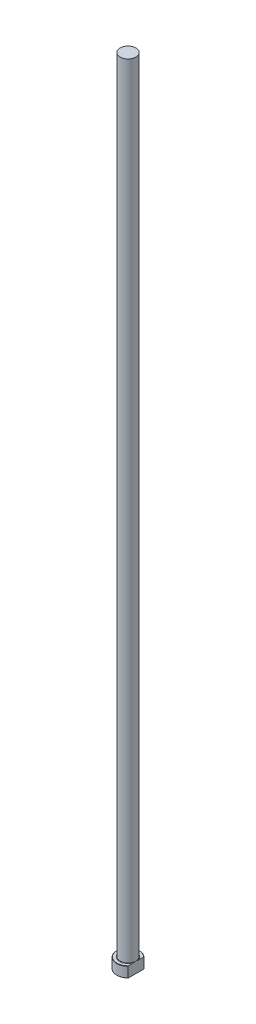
ISO-10303-21;
HEADER;
FILE_DESCRIPTION(('STEP AP214'),'2;1');
FILE_NAME('part.step','',(''),(''),'','','');
FILE_SCHEMA(('AUTOMOTIVE_DESIGN { 1 0 10303 214 1 1 1 1 }'));
ENDSEC;
DATA;
#1=APPLICATION_CONTEXT('core data for automotive mechanical design processes');
#2=APPLICATION_PROTOCOL_DEFINITION('international standard','automotive_design',2000,#1);
#3=PRODUCT_CONTEXT('',#1,'mechanical');
#4=PRODUCT('Part','Part','',(#3));
#5=PRODUCT_RELATED_PRODUCT_CATEGORY('part','',(#4));
#6=PRODUCT_DEFINITION_FORMATION('','',#4);
#7=PRODUCT_DEFINITION_CONTEXT('part definition',#1,'design');
#8=PRODUCT_DEFINITION('design','',#6,#7);
#9=PRODUCT_DEFINITION_SHAPE('','',#8);
#10=(LENGTH_UNIT() NAMED_UNIT(*) SI_UNIT(.MILLI.,.METRE.));
#11=(NAMED_UNIT(*) PLANE_ANGLE_UNIT() SI_UNIT($,.RADIAN.));
#12=(NAMED_UNIT(*) SI_UNIT($,.STERADIAN.) SOLID_ANGLE_UNIT());
#13=UNCERTAINTY_MEASURE_WITH_UNIT(LENGTH_MEASURE(1.E-05),#10,'distance_accuracy_value','');
#14=(GEOMETRIC_REPRESENTATION_CONTEXT(3) GLOBAL_UNCERTAINTY_ASSIGNED_CONTEXT((#13)) GLOBAL_UNIT_ASSIGNED_CONTEXT((#10,
#11,#12)) REPRESENTATION_CONTEXT('',''));
#15=CARTESIAN_POINT('',(0.,0.,0.));
#16=DIRECTION('',(0.,0.,1.));
#17=DIRECTION('',(1.,0.,0.));
#18=AXIS2_PLACEMENT_3D('',#15,#16,#17);
#19=CARTESIAN_POINT('',(0.,0.,0.));
#20=DIRECTION('',(0.,-1.,0.));
#21=DIRECTION('',(0.,0.,-1.));
#22=AXIS2_PLACEMENT_3D('',#19,#20,#21);
#23=PLANE('',#22);
#24=CARTESIAN_POINT('',(0.,0.,0.));
#25=DIRECTION('',(0.,-1.,0.));
#26=DIRECTION('',(0.,0.,-1.));
#27=AXIS2_PLACEMENT_3D('',#24,#25,#26);
#28=CIRCLE('',#27,8.29999999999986);
#29=CARTESIAN_POINT('',(5.99999999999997,0.,5.7349803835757));
#30=VERTEX_POINT('',#29);
#31=CARTESIAN_POINT('',(5.99999999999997,0.,-5.7349803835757));
#32=VERTEX_POINT('',#31);
#33=EDGE_CURVE('E98',#30,#32,#28,.T.);
#34=ORIENTED_EDGE('',*,*,#33,.T.);
#35=DIRECTION('',(0.,0.,1.));
#36=VECTOR('',#35,1.);
#37=CARTESIAN_POINT('',(5.99999999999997,0.,6.02079728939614));
#38=LINE('',#37,#36);
#39=EDGE_CURVE('E83',#32,#30,#38,.T.);
#40=ORIENTED_EDGE('',*,*,#39,.T.);
#41=EDGE_LOOP('',(#34,#40));
#42=FACE_BOUND('',#41,.T.);
#43=ADVANCED_FACE('F32',(#42),#23,.T.);
#44=CARTESIAN_POINT('',(0.,259.958771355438,0.));
#45=DIRECTION('',(0.,1.,0.));
#46=DIRECTION('',(0.,0.,1.));
#47=AXIS2_PLACEMENT_3D('',#44,#45,#46);
#48=CYLINDRICAL_SURFACE('',#47,8.49999999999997);
#49=CARTESIAN_POINT('',(0.,7.79999999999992,0.));
#50=DIRECTION('',(0.,1.,0.));
#51=DIRECTION('',(0.,0.,1.));
#52=AXIS2_PLACEMENT_3D('',#49,#50,#51);
#53=CIRCLE('',#52,8.49999999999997);
#54=CARTESIAN_POINT('',(5.99999999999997,7.79999999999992,6.02079728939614));
#55=VERTEX_POINT('',#54);
#56=CARTESIAN_POINT('',(5.99999999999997,7.79999999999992,-6.02079728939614));
#57=VERTEX_POINT('',#56);
#58=EDGE_CURVE('E104',#55,#57,#53,.F.);
#59=ORIENTED_EDGE('',*,*,#58,.T.);
#60=DIRECTION('',(0.,-1.,0.));
#61=VECTOR('',#60,1.);
#62=CARTESIAN_POINT('',(5.99999999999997,600.,-6.02079728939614));
#63=LINE('',#62,#61);
#64=CARTESIAN_POINT('',(5.99999999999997,0.200000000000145,-6.02079728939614));
#65=VERTEX_POINT('',#64);
#66=EDGE_CURVE('E183',#57,#65,#63,.T.);
#67=ORIENTED_EDGE('',*,*,#66,.T.);
#68=CARTESIAN_POINT('',(0.,0.200000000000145,0.));
#69=DIRECTION('',(0.,-1.,0.));
#70=DIRECTION('',(0.,0.,-1.));
#71=AXIS2_PLACEMENT_3D('',#68,#69,#70);
#72=CIRCLE('',#71,8.49999999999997);
#73=CARTESIAN_POINT('',(5.99999999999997,0.200000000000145,6.02079728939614));
#74=VERTEX_POINT('',#73);
#75=EDGE_CURVE('E100',#65,#74,#72,.F.);
#76=ORIENTED_EDGE('',*,*,#75,.T.);
#77=DIRECTION('',(0.,-1.,0.));
#78=VECTOR('',#77,1.);
#79=CARTESIAN_POINT('',(5.99999999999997,600.,6.02079728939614));
#80=LINE('',#79,#78);
#81=EDGE_CURVE('E93',#55,#74,#80,.T.);
#82=ORIENTED_EDGE('',*,*,#81,.F.);
#83=EDGE_LOOP('',(#59,#67,#76,#82));
#84=FACE_BOUND('',#83,.T.);
#85=ADVANCED_FACE('F158',(#84),#48,.T.);
#86=CARTESIAN_POINT('',(-8.49999999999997,8.,0.));
#87=DIRECTION('',(0.,1.,0.));
#88=DIRECTION('',(0.,0.,1.));
#89=AXIS2_PLACEMENT_3D('',#86,#87,#88);
#90=PLANE('',#89);
#91=CARTESIAN_POINT('',(0.,8.,0.));
#92=DIRECTION('',(0.,1.,0.));
#93=DIRECTION('',(0.,0.,1.));
#94=AXIS2_PLACEMENT_3D('',#91,#92,#93);
#95=CIRCLE('',#94,8.29999999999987);
#96=CARTESIAN_POINT('',(5.99999999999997,8.,-5.73498038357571));
#97=VERTEX_POINT('',#96);
#98=CARTESIAN_POINT('',(5.99999999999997,8.,5.73498038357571));
#99=VERTEX_POINT('',#98);
#100=EDGE_CURVE('E178',#97,#99,#95,.T.);
#101=ORIENTED_EDGE('',*,*,#100,.T.);
#102=DIRECTION('',(0.,0.,-1.));
#103=VECTOR('',#102,1.);
#104=CARTESIAN_POINT('',(5.99999999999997,8.,0.));
#105=LINE('',#104,#103);
#106=CARTESIAN_POINT('',(5.99999999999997,7.99999999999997,1.92093727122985));
#107=VERTEX_POINT('',#106);
#108=EDGE_CURVE('E57',#99,#107,#105,.T.);
#109=ORIENTED_EDGE('',*,*,#108,.T.);
#110=CARTESIAN_POINT('',(0.,8.,0.));
#111=DIRECTION('',(0.,1.,0.));
#112=DIRECTION('',(0.,0.,1.));
#113=AXIS2_PLACEMENT_3D('',#110,#111,#112);
#114=CIRCLE('',#113,6.29999999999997);
#115=CARTESIAN_POINT('',(5.99999999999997,7.99999999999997,-1.92093727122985));
#116=VERTEX_POINT('',#115);
#117=EDGE_CURVE('E107',#107,#116,#114,.F.);
#118=ORIENTED_EDGE('',*,*,#117,.T.);
#119=EDGE_CURVE('E136',#116,#97,#105,.T.);
#120=ORIENTED_EDGE('',*,*,#119,.T.);
#121=EDGE_LOOP('',(#101,#109,#118,#120));
#122=FACE_BOUND('',#121,.T.);
#123=ADVANCED_FACE('F147',(#122),#90,.T.);
#124=CARTESIAN_POINT('',(0.,8.00000000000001,0.));
#125=DIRECTION('',(0.,-1.,0.));
#126=DIRECTION('',(0.,0.,-1.));
#127=AXIS2_PLACEMENT_3D('',#124,#125,#126);
#128=CONICAL_SURFACE('',#127,8.29999999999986,0.785398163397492);
#129=ORIENTED_EDGE('',*,*,#58,.F.);
#130=CARTESIAN_POINT('',(5.99999999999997,1.75758968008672,13.2469505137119));
#131=CARTESIAN_POINT('',(5.99999999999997,1.93438223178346,13.0528651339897));
#132=CARTESIAN_POINT('',(5.99999999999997,2.11081737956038,12.8584542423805));
#133=CARTESIAN_POINT('',(5.99999999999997,2.46286810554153,12.4688887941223));
#134=CARTESIAN_POINT('',(5.99999999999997,2.63848367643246,12.2737342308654));
#135=CARTESIAN_POINT('',(5.99999999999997,3.16402789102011,11.6869221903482));
#136=CARTESIAN_POINT('',(5.99999999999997,3.51256436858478,11.2940145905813));
#137=CARTESIAN_POINT('',(5.99999999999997,4.20737297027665,10.5008820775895));
#138=CARTESIAN_POINT('',(5.99999999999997,4.55360756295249,10.1006242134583));
#139=CARTESIAN_POINT('',(5.99999999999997,5.23924501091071,9.29437446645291));
#140=CARTESIAN_POINT('',(5.99999999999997,5.57864880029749,8.88838338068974));
#141=CARTESIAN_POINT('',(5.99999999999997,6.20014365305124,8.12701556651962));
#142=CARTESIAN_POINT('',(5.99999999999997,6.48350363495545,7.77268056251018));
#143=CARTESIAN_POINT('',(5.99999999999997,6.90118479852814,7.23535305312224));
#144=CARTESIAN_POINT('',(5.99999999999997,7.03920968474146,7.05523994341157));
#145=CARTESIAN_POINT('',(5.99999999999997,7.31228512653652,6.69277597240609));
#146=CARTESIAN_POINT('',(5.99999999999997,7.4473357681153,6.51042517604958));
#147=CARTESIAN_POINT('',(5.99999999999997,7.71365491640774,6.14339029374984));
#148=CARTESIAN_POINT('',(5.99999999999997,7.84492875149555,5.95871008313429));
#149=CARTESIAN_POINT('',(5.99999999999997,8.10310710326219,5.58632824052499));
#150=CARTESIAN_POINT('',(5.99999999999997,8.23001189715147,5.3986268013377));
#151=CARTESIAN_POINT('',(5.99999999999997,8.47838103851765,5.01977879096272));
#152=CARTESIAN_POINT('',(5.99999999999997,8.59984807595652,4.828633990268));
#153=CARTESIAN_POINT('',(5.99999999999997,8.8360687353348,4.44225695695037));
#154=CARTESIAN_POINT('',(5.99999999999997,8.95082335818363,4.24702533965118));
#155=CARTESIAN_POINT('',(5.99999999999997,9.16834438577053,3.85819092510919));
#156=CARTESIAN_POINT('',(5.99999999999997,9.27137801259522,3.66473854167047));
#157=CARTESIAN_POINT('',(5.99999999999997,9.46754050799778,3.27281000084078));
#158=CARTESIAN_POINT('',(5.99999999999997,9.56066848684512,3.07433339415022));
#159=CARTESIAN_POINT('',(5.99999999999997,9.73431152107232,2.67227927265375));
#160=CARTESIAN_POINT('',(5.99999999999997,9.81484758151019,2.46871092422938));
#161=CARTESIAN_POINT('',(5.99999999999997,9.96042306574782,2.05607448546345));
#162=CARTESIAN_POINT('',(5.99999999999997,10.0254667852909,1.84700793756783));
#163=CARTESIAN_POINT('',(5.99999999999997,10.1264114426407,1.46315432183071));
#164=CARTESIAN_POINT('',(5.99999999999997,10.165480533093,1.28920535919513));
#165=CARTESIAN_POINT('',(5.99999999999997,10.2294553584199,0.938706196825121));
#166=CARTESIAN_POINT('',(5.99999999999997,10.2543631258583,0.762156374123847));
#167=CARTESIAN_POINT('',(5.99999999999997,10.2887297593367,0.407890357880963));
#168=CARTESIAN_POINT('',(5.99999999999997,10.2982190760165,0.230177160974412));
#169=CARTESIAN_POINT('',(5.99999999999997,10.3013234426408,-0.125392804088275));
#170=CARTESIAN_POINT('',(5.99999999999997,10.2949382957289,-0.30324957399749));
#171=CARTESIAN_POINT('',(5.99999999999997,10.2666831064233,-0.65724997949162));
#172=CARTESIAN_POINT('',(5.99999999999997,10.2448527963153,-0.833396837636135));
#173=CARTESIAN_POINT('',(5.99999999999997,10.1868620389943,-1.18332422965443));
#174=CARTESIAN_POINT('',(5.99999999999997,10.1506981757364,-1.35710418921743));
#175=CARTESIAN_POINT('',(5.99999999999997,10.0655340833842,-1.70193222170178));
#176=CARTESIAN_POINT('',(5.99999999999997,10.0165006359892,-1.87297199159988));
#177=CARTESIAN_POINT('',(5.99999999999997,9.90743707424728,-2.21145638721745));
#178=CARTESIAN_POINT('',(5.99999999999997,9.8474075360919,-2.37890120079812));
#179=CARTESIAN_POINT('',(5.99999999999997,9.69449933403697,-2.77055604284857));
#180=CARTESIAN_POINT('',(5.99999999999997,9.59762441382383,-2.99320000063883));
#181=CARTESIAN_POINT('',(5.99999999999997,9.39041412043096,-3.43217897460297));
#182=CARTESIAN_POINT('',(5.99999999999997,9.28007160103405,-3.64851056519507));
#183=CARTESIAN_POINT('',(5.99999999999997,9.04872697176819,-4.07594347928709));
#184=CARTESIAN_POINT('',(5.99999999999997,8.92770286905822,-4.28703280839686));
#185=CARTESIAN_POINT('',(5.99999999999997,8.67752421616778,-4.70425268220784));
#186=CARTESIAN_POINT('',(5.99999999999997,8.54837109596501,-4.91038409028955));
#187=CARTESIAN_POINT('',(5.99999999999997,8.28223284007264,-5.3206400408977));
#188=CARTESIAN_POINT('',(5.99999999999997,8.14517883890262,-5.52471970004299));
#189=CARTESIAN_POINT('',(5.99999999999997,7.86585169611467,-5.9292712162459));
#190=CARTESIAN_POINT('',(5.99999999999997,7.7235783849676,-6.12974295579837));
#191=CARTESIAN_POINT('',(5.99999999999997,7.43500571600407,-6.52738897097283));
#192=CARTESIAN_POINT('',(5.99999999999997,7.28871143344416,-6.72456694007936));
#193=CARTESIAN_POINT('',(5.99999999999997,6.99270011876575,-7.11633919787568));
#194=CARTESIAN_POINT('',(5.99999999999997,6.84298299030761,-7.3109334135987));
#195=CARTESIAN_POINT('',(5.99999999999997,6.49456418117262,-7.75702816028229));
#196=CARTESIAN_POINT('',(5.99999999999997,6.29487025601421,-8.0077529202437));
#197=CARTESIAN_POINT('',(5.99999999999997,5.89169138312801,-8.50613413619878));
#198=CARTESIAN_POINT('',(5.99999999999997,5.68820636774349,-8.7537905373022));
#199=CARTESIAN_POINT('',(5.99999999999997,5.27809760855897,-9.24667622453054));
#200=CARTESIAN_POINT('',(5.99999999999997,5.07147248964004,-9.4919043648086));
#201=CARTESIAN_POINT('',(5.99999999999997,4.65573644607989,-9.98024423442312));
#202=CARTESIAN_POINT('',(5.99999999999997,4.44662550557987,-10.2233559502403));
#203=CARTESIAN_POINT('',(5.99999999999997,4.03294810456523,-10.7001949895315));
#204=CARTESIAN_POINT('',(5.99999999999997,3.82844502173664,-10.9339773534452));
#205=CARTESIAN_POINT('',(5.99999999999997,3.41782118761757,-11.4001180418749));
#206=CARTESIAN_POINT('',(5.99999999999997,3.21170042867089,-11.6324763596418));
#207=CARTESIAN_POINT('',(5.99999999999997,2.79824862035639,-12.0957939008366));
#208=CARTESIAN_POINT('',(5.99999999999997,2.59091861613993,-12.3267540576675));
#209=CARTESIAN_POINT('',(5.99999999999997,2.17508648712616,-12.7876097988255));
#210=CARTESIAN_POINT('',(5.99999999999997,1.96658438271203,-13.0175054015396));
#211=CARTESIAN_POINT('',(5.99999999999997,1.75758968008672,-13.2469505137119));
#212=B_SPLINE_CURVE_WITH_KNOTS('',3,(#130,#131,#132,#133,#134,#135,#136,#137,#138,#139,#140,
#141,#142,#143,#144,#145,#146,#147,#148,#149,#150,#151,#152,#153,#154,#155,#156,#157,#158,#159,
#160,#161,#162,#163,#164,#165,#166,#167,#168,#169,#170,#171,#172,#173,#174,#175,#176,#177,#178,
#179,#180,#181,#182,#183,#184,#185,#186,#187,#188,#189,#190,#191,#192,#193,#194,#195,#196,#197,
#198,#199,#200,#201,#202,#203,#204,#205,#206,#207,#208,#209,#210,#211),.UNSPECIFIED.,.F.,.F.,(4,
2,2,2,2,2,2,2,2,2,2,2,2,2,2,2,2,2,2,2,2,2,2,2,2,2,2,2,2,2,2,2,2,2,2,2,2,2,2,2,4),(0.,
0.78760481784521,1.57521665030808,3.15083930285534,4.73847641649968,6.32589492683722,
7.68685989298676,8.36758868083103,9.04829776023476,9.72799402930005,10.407647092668,
11.0869601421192,11.7661716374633,12.4234853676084,13.0808580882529,13.7371222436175,
14.3932042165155,14.9275387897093,15.4617966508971,15.9949980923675,16.5282061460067,
17.0600474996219,17.5920156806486,18.1253706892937,18.6586977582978,19.3865060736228,
20.1147022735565,20.8444344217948,21.5740385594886,22.3114278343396,23.0488410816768,
23.7853628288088,24.5219053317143,25.4834511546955,26.4450141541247,27.4070111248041,
28.3690142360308,29.3008217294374,30.2326336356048,31.1637335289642,32.094817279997),.UNSPECIFIED.);
#213=EDGE_CURVE('E135',#55,#99,#212,.T.);
#214=ORIENTED_EDGE('',*,*,#213,.T.);
#215=ORIENTED_EDGE('',*,*,#100,.F.);
#216=EDGE_CURVE('E127',#97,#57,#212,.T.);
#217=ORIENTED_EDGE('',*,*,#216,.T.);
#218=EDGE_LOOP('',(#129,#214,#215,#217));
#219=FACE_BOUND('',#218,.T.);
#220=ADVANCED_FACE('F143',(#219),#128,.T.);
#221=CARTESIAN_POINT('',(0.,0.200000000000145,0.));
#222=DIRECTION('',(0.,1.,0.));
#223=DIRECTION('',(0.,0.,1.));
#224=AXIS2_PLACEMENT_3D('',#221,#222,#223);
#225=CONICAL_SURFACE('',#224,8.49999999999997,0.785398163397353);
#226=ORIENTED_EDGE('',*,*,#75,.F.);
#227=CARTESIAN_POINT('',(5.99999999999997,6.24241031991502,-13.2469505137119));
#228=CARTESIAN_POINT('',(5.99999999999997,6.06561776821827,-13.0528651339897));
#229=CARTESIAN_POINT('',(5.99999999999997,5.88918262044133,-12.8584542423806));
#230=CARTESIAN_POINT('',(5.99999999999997,5.53713189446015,-12.4688887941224));
#231=CARTESIAN_POINT('',(5.99999999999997,5.3615163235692,-12.2737342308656));
#232=CARTESIAN_POINT('',(5.99999999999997,4.8359721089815,-11.6869221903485));
#233=CARTESIAN_POINT('',(5.99999999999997,4.48743563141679,-11.2940145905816));
#234=CARTESIAN_POINT('',(5.99999999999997,3.79262702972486,-10.50088207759));
#235=CARTESIAN_POINT('',(5.99999999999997,3.44639243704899,-10.1006242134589));
#236=CARTESIAN_POINT('',(5.99999999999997,2.76075498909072,-9.29437446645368));
#237=CARTESIAN_POINT('',(5.99999999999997,2.42135119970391,-8.8883833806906));
#238=CARTESIAN_POINT('',(5.99999999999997,1.7998563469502,-8.12701556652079));
#239=CARTESIAN_POINT('',(5.99999999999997,1.51649636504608,-7.77268056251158));
#240=CARTESIAN_POINT('',(5.99999999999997,1.09881520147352,-7.23535305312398));
#241=CARTESIAN_POINT('',(5.99999999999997,0.960790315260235,-7.05523994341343));
#242=CARTESIAN_POINT('',(5.99999999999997,0.687714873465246,-6.69277597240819));
#243=CARTESIAN_POINT('',(5.99999999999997,0.552664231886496,-6.5104251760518));
#244=CARTESIAN_POINT('',(5.99999999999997,0.286345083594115,-6.14339029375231));
#245=CARTESIAN_POINT('',(5.99999999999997,0.155071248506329,-5.95871008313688));
#246=CARTESIAN_POINT('',(5.99999999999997,-0.103107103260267,-5.58632824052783));
#247=CARTESIAN_POINT('',(5.99999999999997,-0.230011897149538,-5.39862680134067));
#248=CARTESIAN_POINT('',(5.99999999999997,-0.478381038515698,-5.01977879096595));
#249=CARTESIAN_POINT('',(5.99999999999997,-0.599848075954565,-4.82863399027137));
#250=CARTESIAN_POINT('',(5.99999999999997,-0.836068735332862,-4.44225695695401));
#251=CARTESIAN_POINT('',(5.99999999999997,-0.950823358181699,-4.24702533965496));
#252=CARTESIAN_POINT('',(5.99999999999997,-1.16834438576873,-3.8581909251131));
#253=CARTESIAN_POINT('',(5.99999999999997,-1.27137801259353,-3.66473854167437));
#254=CARTESIAN_POINT('',(5.99999999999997,-1.46754050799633,-3.27281000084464));
#255=CARTESIAN_POINT('',(5.99999999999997,-1.56066848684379,-3.07433339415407));
#256=CARTESIAN_POINT('',(5.99999999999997,-1.73431152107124,-2.67227927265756));
#257=CARTESIAN_POINT('',(5.99999999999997,-1.81484758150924,-2.46871092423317));
#258=CARTESIAN_POINT('',(5.99999999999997,-1.96042306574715,-2.05607448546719));
#259=CARTESIAN_POINT('',(5.99999999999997,-2.02546678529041,-1.84700793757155));
#260=CARTESIAN_POINT('',(5.99999999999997,-2.12641144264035,-1.46315432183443));
#261=CARTESIAN_POINT('',(5.99999999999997,-2.16548053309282,-1.28920535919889));
#262=CARTESIAN_POINT('',(5.99999999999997,-2.22945535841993,-0.938706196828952));
#263=CARTESIAN_POINT('',(5.99999999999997,-2.25436312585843,-0.76215637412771));
#264=CARTESIAN_POINT('',(5.99999999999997,-2.28872975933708,-0.407890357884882));
#265=CARTESIAN_POINT('',(5.99999999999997,-2.298219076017,-0.230177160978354));
#266=CARTESIAN_POINT('',(5.99999999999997,-2.30132344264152,0.125392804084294));
#267=CARTESIAN_POINT('',(5.99999999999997,-2.29493829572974,0.303249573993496));
#268=CARTESIAN_POINT('',(5.99999999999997,-2.2666831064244,0.657249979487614));
#269=CARTESIAN_POINT('',(5.99999999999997,-2.24485279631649,0.833396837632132));
#270=CARTESIAN_POINT('',(5.99999999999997,-2.18686203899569,1.18332422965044));
#271=CARTESIAN_POINT('',(5.99999999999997,-2.15069817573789,1.35710418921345));
#272=CARTESIAN_POINT('',(5.99999999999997,-2.06553408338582,1.70193222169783));
#273=CARTESIAN_POINT('',(5.99999999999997,-2.01650063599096,1.87297199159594));
#274=CARTESIAN_POINT('',(5.99999999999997,-1.90743707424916,2.21145638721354));
#275=CARTESIAN_POINT('',(5.99999999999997,-1.84740753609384,2.37890120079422));
#276=CARTESIAN_POINT('',(5.99999999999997,-1.69449933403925,2.77055604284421));
#277=CARTESIAN_POINT('',(5.99999999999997,-1.59762441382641,2.99320000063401));
#278=CARTESIAN_POINT('',(5.99999999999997,-1.39041412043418,3.43217897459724));
#279=CARTESIAN_POINT('',(5.99999999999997,-1.2800716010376,3.6485105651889));
#280=CARTESIAN_POINT('',(5.99999999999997,-1.04872697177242,4.07594347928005));
#281=CARTESIAN_POINT('',(5.99999999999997,-0.927702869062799,4.2870328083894));
#282=CARTESIAN_POINT('',(5.99999999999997,-0.677524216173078,4.70425268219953));
#283=CARTESIAN_POINT('',(5.99999999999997,-0.548371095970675,4.91038409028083));
#284=CARTESIAN_POINT('',(5.99999999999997,-0.282232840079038,5.32064004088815));
#285=CARTESIAN_POINT('',(5.99999999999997,-0.1451788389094,5.52471970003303));
#286=CARTESIAN_POINT('',(5.99999999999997,0.134148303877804,5.92927121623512));
#287=CARTESIAN_POINT('',(5.99999999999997,0.276421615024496,6.12974295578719));
#288=CARTESIAN_POINT('',(5.99999999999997,0.564994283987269,6.52738897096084));
#289=CARTESIAN_POINT('',(5.99999999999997,0.711288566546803,6.72456694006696));
#290=CARTESIAN_POINT('',(5.99999999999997,1.00729988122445,7.11633919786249));
#291=CARTESIAN_POINT('',(5.99999999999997,1.15701700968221,7.31093341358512));
#292=CARTESIAN_POINT('',(5.99999999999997,1.50543581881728,7.757028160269));
#293=CARTESIAN_POINT('',(5.99999999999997,1.70512974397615,8.00775292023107));
#294=CARTESIAN_POINT('',(5.99999999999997,2.10830861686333,8.50613413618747));
#295=CARTESIAN_POINT('',(5.99999999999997,2.31179363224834,8.75379053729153));
#296=CARTESIAN_POINT('',(5.99999999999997,2.7219023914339,9.24667622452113));
#297=CARTESIAN_POINT('',(5.99999999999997,2.92852751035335,9.49190436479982));
#298=CARTESIAN_POINT('',(5.99999999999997,3.34426355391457,9.98024423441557));
#299=CARTESIAN_POINT('',(5.99999999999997,3.55337449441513,10.2233559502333));
#300=CARTESIAN_POINT('',(5.99999999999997,3.96705189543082,10.7001949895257));
#301=CARTESIAN_POINT('',(5.99999999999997,4.17155497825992,10.9339773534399));
#302=CARTESIAN_POINT('',(5.99999999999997,4.58217881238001,11.4001180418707));
#303=CARTESIAN_POINT('',(5.99999999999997,4.7882995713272,11.6324763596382));
#304=CARTESIAN_POINT('',(5.99999999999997,5.20175137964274,12.095793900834));
#305=CARTESIAN_POINT('',(5.99999999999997,5.40908138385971,12.3267540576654));
#306=CARTESIAN_POINT('',(5.99999999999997,5.82491351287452,12.7876097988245));
#307=CARTESIAN_POINT('',(5.99999999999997,6.03341561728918,13.0175054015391));
#308=CARTESIAN_POINT('',(5.99999999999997,6.24241031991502,13.2469505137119));
#309=B_SPLINE_CURVE_WITH_KNOTS('',3,(#227,#228,#229,#230,#231,#232,#233,#234,#235,#236,#237,
#238,#239,#240,#241,#242,#243,#244,#245,#246,#247,#248,#249,#250,#251,#252,#253,#254,#255,#256,
#257,#258,#259,#260,#261,#262,#263,#264,#265,#266,#267,#268,#269,#270,#271,#272,#273,#274,#275,
#276,#277,#278,#279,#280,#281,#282,#283,#284,#285,#286,#287,#288,#289,#290,#291,#292,#293,#294,
#295,#296,#297,#298,#299,#300,#301,#302,#303,#304,#305,#306,#307,#308),.UNSPECIFIED.,.F.,.F.,(4,
2,2,2,2,2,2,2,2,2,2,2,2,2,2,2,2,2,2,2,2,2,2,2,2,2,2,2,2,2,2,2,2,2,2,2,2,2,2,2,4),(0.,
0.787604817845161,1.57521665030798,3.15083930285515,4.73847641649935,6.32589492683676,
7.68685989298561,8.36758868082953,9.0482977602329,9.72799402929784,10.4076470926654,
11.0869601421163,11.76617163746,12.4234853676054,13.08085808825,13.7371222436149,
14.3932042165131,14.9275387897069,15.4617966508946,15.9949980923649,16.5282061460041,
17.0600474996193,17.5920156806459,18.125370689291,18.658697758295,19.3865060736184,
20.1147022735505,20.8444344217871,21.5740385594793,22.3114278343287,23.0488410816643,
23.7853628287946,24.5219053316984,25.4834511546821,26.4450141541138,27.4070111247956,
28.3690142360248,29.3008217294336,30.2326336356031,31.1637335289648,32.0948172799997),.UNSPECIFIED.);
#310=EDGE_CURVE('E86',#65,#32,#309,.T.);
#311=ORIENTED_EDGE('',*,*,#310,.T.);
#312=ORIENTED_EDGE('',*,*,#33,.F.);
#313=EDGE_CURVE('E89',#30,#74,#309,.T.);
#314=ORIENTED_EDGE('',*,*,#313,.T.);
#315=EDGE_LOOP('',(#226,#311,#312,#314));
#316=FACE_BOUND('',#315,.T.);
#317=ADVANCED_FACE('F97',(#316),#225,.T.);
#318=CARTESIAN_POINT('',(0.,8.29999999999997,0.));
#319=DIRECTION('',(0.,1.,0.));
#320=DIRECTION('',(0.,0.,1.));
#321=AXIS2_PLACEMENT_3D('',#318,#319,#320);
#322=TOROIDAL_SURFACE('',#321,6.29999999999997,0.3);
#323=CARTESIAN_POINT('',(5.99999999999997,8.29999999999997,0.));
#324=CARTESIAN_POINT('',(5.99999999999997,8.30000062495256,1.34604190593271E-10));
#325=CARTESIAN_POINT('',(5.99999999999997,8.30000124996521,-2.85495124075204E-07));
#326=CARTESIAN_POINT('',(5.99999999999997,8.30000241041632,-1.04928093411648E-06));
#327=CARTESIAN_POINT('',(5.99999999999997,8.3000029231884,-1.54785174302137E-06));
#328=CARTESIAN_POINT('',(5.99999999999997,8.30000401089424,-2.74944388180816E-06));
#329=CARTESIAN_POINT('',(5.99999999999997,8.30000456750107,-3.47196545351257E-06));
#330=CARTESIAN_POINT('',(5.99999999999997,8.30000554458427,-4.95172589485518E-06));
#331=CARTESIAN_POINT('',(5.99999999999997,8.30000596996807,-5.70604371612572E-06));
#332=CARTESIAN_POINT('',(5.99999999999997,8.30000759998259,-8.69525120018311E-06));
#333=CARTESIAN_POINT('',(5.99999999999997,8.30000872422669,-1.09781829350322E-05));
#334=CARTESIAN_POINT('',(5.99999999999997,8.30001052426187,-1.54456348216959E-05));
#335=CARTESIAN_POINT('',(5.99999999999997,8.30001123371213,-1.7617076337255E-05));
#336=CARTESIAN_POINT('',(5.99999999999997,8.30001429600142,-2.6992812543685E-05));
#337=CARTESIAN_POINT('',(5.99999999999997,8.30001664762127,-3.4200026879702E-05));
#338=CARTESIAN_POINT('',(5.99999999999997,8.30002002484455,-4.76829004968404E-05));
#339=CARTESIAN_POINT('',(5.99999999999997,8.30002120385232,-5.39195612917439E-05));
#340=CARTESIAN_POINT('',(5.99999999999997,8.3000299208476,-0.000100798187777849));
#341=CARTESIAN_POINT('',(5.99999999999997,8.30003667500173,-0.00014152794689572));
#342=CARTESIAN_POINT('',(5.99999999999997,8.30006623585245,-0.000303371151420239));
#343=CARTESIAN_POINT('',(5.99999999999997,8.30009428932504,-0.000423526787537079));
#344=CARTESIAN_POINT('',(5.99999999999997,8.30020425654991,-0.000901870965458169));
#345=CARTESIAN_POINT('',(5.99999999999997,8.30028289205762,-0.00126055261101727));
#346=CARTESIAN_POINT('',(5.99999999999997,8.3005993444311,-0.00269405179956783));
#347=CARTESIAN_POINT('',(5.99999999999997,8.30084137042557,-0.00376821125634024));
#348=CARTESIAN_POINT('',(5.99999999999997,8.30185255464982,-0.0082672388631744));
#349=CARTESIAN_POINT('',(5.99999999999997,8.30261638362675,-0.0116929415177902));
#350=CARTESIAN_POINT('',(5.99999999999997,8.30945824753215,-0.0423635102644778));
#351=CARTESIAN_POINT('',(5.99999999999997,8.31555811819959,-0.0696050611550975));
#352=CARTESIAN_POINT('',(5.99999999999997,8.3274771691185,-0.122985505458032));
#353=CARTESIAN_POINT('',(5.99999999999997,8.33329766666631,-0.149124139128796));
#354=CARTESIAN_POINT('',(5.99999999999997,8.34565922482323,-0.204790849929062));
#355=CARTESIAN_POINT('',(5.99999999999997,8.35219607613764,-0.234319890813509));
#356=CARTESIAN_POINT('',(5.99999999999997,8.36527652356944,-0.293721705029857));
#357=CARTESIAN_POINT('',(5.99999999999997,8.37181938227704,-0.323594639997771));
#358=CARTESIAN_POINT('',(5.99999999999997,8.38741819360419,-0.395325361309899));
#359=CARTESIAN_POINT('',(5.99999999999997,8.39643140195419,-0.437192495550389));
#360=CARTESIAN_POINT('',(5.99999999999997,8.41397520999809,-0.519837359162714));
#361=CARTESIAN_POINT('',(5.99999999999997,8.42251226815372,-0.560613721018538));
#362=CARTESIAN_POINT('',(5.99999999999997,8.45005469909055,-0.694529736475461));
#363=CARTESIAN_POINT('',(5.99999999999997,8.4684527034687,-0.787796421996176));
#364=CARTESIAN_POINT('',(5.99999999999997,8.50309772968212,-0.975673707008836));
#365=CARTESIAN_POINT('',(5.99999999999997,8.51932210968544,-1.07028855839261));
#366=CARTESIAN_POINT('',(5.99999999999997,8.54979671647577,-1.26922112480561));
#367=CARTESIAN_POINT('',(5.99999999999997,8.56370439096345,-1.37359247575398));
#368=CARTESIAN_POINT('',(5.99999999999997,8.58567213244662,-1.58267692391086));
#369=CARTESIAN_POINT('',(5.99999999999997,8.59375049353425,-1.6873879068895));
#370=CARTESIAN_POINT('',(5.99999999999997,8.59943466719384,-1.84308999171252));
#371=CARTESIAN_POINT('',(5.99999999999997,8.60029184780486,-1.89396002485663));
#372=CARTESIAN_POINT('',(5.99999999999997,8.5995288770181,-1.99574511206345));
#373=CARTESIAN_POINT('',(5.99999999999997,8.59790613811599,-2.04666015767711));
#374=CARTESIAN_POINT('',(5.99999999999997,8.59158346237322,-2.14740525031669));
#375=CARTESIAN_POINT('',(5.99999999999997,8.58693864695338,-2.1972385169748));
#376=CARTESIAN_POINT('',(5.99999999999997,8.57369485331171,-2.29634018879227));
#377=CARTESIAN_POINT('',(5.99999999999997,8.56510170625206,-2.34560931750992));
#378=CARTESIAN_POINT('',(5.99999999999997,8.54513600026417,-2.43101613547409));
#379=CARTESIAN_POINT('',(5.99999999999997,8.53495732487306,-2.46741817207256));
#380=CARTESIAN_POINT('',(5.99999999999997,8.5163599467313,-2.52083307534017));
#381=CARTESIAN_POINT('',(5.99999999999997,8.50961541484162,-2.53842082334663));
#382=CARTESIAN_POINT('',(5.99999999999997,8.49476050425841,-2.57300282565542));
#383=CARTESIAN_POINT('',(5.99999999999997,8.48665036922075,-2.58999718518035));
#384=CARTESIAN_POINT('',(5.99999999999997,8.4656679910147,-2.62872971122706));
#385=CARTESIAN_POINT('',(5.99999999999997,8.45211281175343,-2.65012863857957));
#386=CARTESIAN_POINT('',(5.99999999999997,8.42848584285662,-2.67978235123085));
#387=CARTESIAN_POINT('',(5.99999999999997,8.42001211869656,-2.68929941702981));
#388=CARTESIAN_POINT('',(5.99999999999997,8.40175979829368,-2.70700164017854));
#389=CARTESIAN_POINT('',(5.99999999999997,8.3919842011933,-2.71518976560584));
#390=CARTESIAN_POINT('',(5.99999999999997,8.37475773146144,-2.72695700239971));
#391=CARTESIAN_POINT('',(5.99999999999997,8.36772137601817,-2.73113834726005));
#392=CARTESIAN_POINT('',(5.99999999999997,8.35309194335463,-2.73838811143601));
#393=CARTESIAN_POINT('',(5.99999999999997,8.34549938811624,-2.7414575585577));
#394=CARTESIAN_POINT('',(5.99999999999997,8.32979919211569,-2.74623687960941));
#395=CARTESIAN_POINT('',(5.99999999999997,8.32168697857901,-2.74793213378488));
#396=CARTESIAN_POINT('',(5.99999999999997,8.30528814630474,-2.74970225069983));
#397=CARTESIAN_POINT('',(5.99999999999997,8.29700168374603,-2.74977850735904));
#398=CARTESIAN_POINT('',(5.99999999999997,8.2816016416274,-2.74839814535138));
#399=CARTESIAN_POINT('',(5.99999999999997,8.27447007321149,-2.74713049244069));
#400=CARTESIAN_POINT('',(5.99999999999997,8.26050316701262,-2.74347158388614));
#401=CARTESIAN_POINT('',(5.99999999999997,8.25366802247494,-2.7410796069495));
#402=CARTESIAN_POINT('',(5.99999999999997,8.23783277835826,-2.73423902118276));
#403=CARTESIAN_POINT('',(5.99999999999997,8.22902314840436,-2.72935244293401));
#404=CARTESIAN_POINT('',(5.99999999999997,8.21228574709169,-2.7182516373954));
#405=CARTESIAN_POINT('',(5.99999999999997,8.20436026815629,-2.71203407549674));
#406=CARTESIAN_POINT('',(5.99999999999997,8.18433696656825,-2.69420240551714));
#407=CARTESIAN_POINT('',(5.99999999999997,8.17298706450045,-2.68175715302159));
#408=CARTESIAN_POINT('',(5.99999999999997,8.15219498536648,-2.65539556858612));
#409=CARTESIAN_POINT('',(5.99999999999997,8.14275658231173,-2.64147640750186));
#410=CARTESIAN_POINT('',(5.99999999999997,8.12508934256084,-2.61223187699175));
#411=CARTESIAN_POINT('',(5.99999999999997,8.11691464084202,-2.59687428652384));
#412=CARTESIAN_POINT('',(5.99999999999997,8.10186133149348,-2.56552911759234));
#413=CARTESIAN_POINT('',(5.99999999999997,8.09498416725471,-2.54954086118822));
#414=CARTESIAN_POINT('',(5.99999999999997,8.07586257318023,-2.50075322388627));
#415=CARTESIAN_POINT('',(5.99999999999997,8.06523495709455,-2.46732486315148));
#416=CARTESIAN_POINT('',(5.99999999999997,8.04175411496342,-2.38014114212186));
#417=CARTESIAN_POINT('',(5.99999999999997,8.0311656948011,-2.32580591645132));
#418=CARTESIAN_POINT('',(5.99999999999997,8.01502027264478,-2.21628778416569));
#419=CARTESIAN_POINT('',(5.99999999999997,8.00947977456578,-2.16110269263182));
#420=CARTESIAN_POINT('',(5.99999999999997,8.00227593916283,-2.05225433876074));
#421=CARTESIAN_POINT('',(5.99999999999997,8.00049528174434,-1.99859827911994));
#422=CARTESIAN_POINT('',(5.99999999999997,7.99968738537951,-1.89155586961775));
#423=CARTESIAN_POINT('',(5.99999999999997,8.00064591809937,-1.8381695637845));
#424=CARTESIAN_POINT('',(5.99999999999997,8.00516082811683,-1.72092619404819));
#425=CARTESIAN_POINT('',(5.99999999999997,8.0091939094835,-1.65708843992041));
#426=CARTESIAN_POINT('',(5.99999999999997,8.01973827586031,-1.52965474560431));
#427=CARTESIAN_POINT('',(5.99999999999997,8.02624848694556,-1.46605871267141));
#428=CARTESIAN_POINT('',(5.99999999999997,8.04143114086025,-1.33760082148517));
#429=CARTESIAN_POINT('',(5.99999999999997,8.05015116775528,-1.27274468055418));
#430=CARTESIAN_POINT('',(5.99999999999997,8.06927542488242,-1.14310871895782));
#431=CARTESIAN_POINT('',(5.99999999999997,8.07968406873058,-1.07832955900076));
#432=CARTESIAN_POINT('',(5.99999999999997,8.10594320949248,-0.924890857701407));
#433=CARTESIAN_POINT('',(5.99999999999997,8.12237584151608,-0.83633166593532));
#434=CARTESIAN_POINT('',(5.99999999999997,8.15676035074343,-0.660568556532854));
#435=CARTESIAN_POINT('',(5.99999999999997,8.1746926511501,-0.573360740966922));
#436=CARTESIAN_POINT('',(5.99999999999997,8.2094636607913,-0.409309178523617));
#437=CARTESIAN_POINT('',(5.99999999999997,8.22618667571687,-0.332440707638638));
#438=CARTESIAN_POINT('',(5.99999999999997,8.25202386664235,-0.215187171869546));
#439=CARTESIAN_POINT('',(5.99999999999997,8.26098977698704,-0.174768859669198));
#440=CARTESIAN_POINT('',(5.99999999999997,8.27885525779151,-0.0946083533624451));
#441=CARTESIAN_POINT('',(5.99999999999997,8.28775352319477,-0.0548658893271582));
#442=CARTESIAN_POINT('',(5.99999999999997,8.29738533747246,-0.0116849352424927));
#443=CARTESIAN_POINT('',(5.99999999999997,8.29815099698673,-0.00825124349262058));
#444=CARTESIAN_POINT('',(5.99999999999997,8.29916260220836,-0.00375043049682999));
#445=CARTESIAN_POINT('',(5.99999999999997,8.29940322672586,-0.00268247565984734));
#446=CARTESIAN_POINT('',(5.99999999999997,8.29971797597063,-0.00125668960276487));
#447=CARTESIAN_POINT('',(5.99999999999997,8.29979628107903,-0.000899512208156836));
#448=CARTESIAN_POINT('',(5.99999999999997,8.29990585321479,-0.000422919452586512));
#449=CARTESIAN_POINT('',(5.99999999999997,8.29993385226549,-0.000303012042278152));
#450=CARTESIAN_POINT('',(5.99999999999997,8.29996336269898,-0.000141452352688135));
#451=CARTESIAN_POINT('',(5.99999999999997,8.29997011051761,-0.000100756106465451));
#452=CARTESIAN_POINT('',(5.99999999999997,8.29997881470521,-5.39118918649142E-05));
#453=CARTESIAN_POINT('',(5.99999999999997,8.29997999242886,-4.76769650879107E-05));
#454=CARTESIAN_POINT('',(5.99999999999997,8.29998336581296,-3.41977672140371E-05));
#455=CARTESIAN_POINT('',(5.99999999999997,8.29998571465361,-2.69924045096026E-05));
#456=CARTESIAN_POINT('',(5.99999999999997,8.29998877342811,-1.76186230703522E-05));
#457=CARTESIAN_POINT('',(5.99999999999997,8.29998948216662,-1.54473109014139E-05));
#458=CARTESIAN_POINT('',(5.99999999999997,8.29999128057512,-1.09800126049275E-05));
#459=CARTESIAN_POINT('',(5.99999999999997,8.29999240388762,-8.69708716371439E-06));
#460=CARTESIAN_POINT('',(5.99999999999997,8.29999403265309,-5.70776687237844E-06));
#461=CARTESIAN_POINT('',(5.99999999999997,8.29999445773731,-4.95337958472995E-06));
#462=CARTESIAN_POINT('',(5.99999999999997,8.29999543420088,-3.47342614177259E-06));
#463=CARTESIAN_POINT('',(5.99999999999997,8.29999599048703,-2.75077832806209E-06));
#464=CARTESIAN_POINT('',(5.99999999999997,8.29999707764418,-1.54889531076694E-06));
#465=CARTESIAN_POINT('',(5.99999999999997,8.29999759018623,-1.05017220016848E-06));
#466=CARTESIAN_POINT('',(5.99999999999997,8.29999875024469,-2.85992440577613E-07));
#467=CARTESIAN_POINT('',(5.99999999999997,8.29999937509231,-1.34594515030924E-10));
#468=CARTESIAN_POINT('',(5.99999999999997,8.29999999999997,0.));
#469=B_SPLINE_CURVE_WITH_KNOTS('',3,(#323,#324,#325,#326,#327,#328,#329,#330,#331,#332,#333,
#334,#335,#336,#337,#338,#339,#340,#341,#342,#343,#344,#345,#346,#347,#348,#349,#350,#351,#352,
#353,#354,#355,#356,#357,#358,#359,#360,#361,#362,#363,#364,#365,#366,#367,#368,#369,#370,#371,
#372,#373,#374,#375,#376,#377,#378,#379,#380,#381,#382,#383,#384,#385,#386,#387,#388,#389,#390,
#391,#392,#393,#394,#395,#396,#397,#398,#399,#400,#401,#402,#403,#404,#405,#406,#407,#408,#409,
#410,#411,#412,#413,#414,#415,#416,#417,#418,#419,#420,#421,#422,#423,#424,#425,#426,#427,#428,
#429,#430,#431,#432,#433,#434,#435,#436,#437,#438,#439,#440,#441,#442,#443,#444,#445,#446,#447,
#448,#449,#450,#451,#452,#453,#454,#455,#456,#457,#458,#459,#460,#461,#462,#463,#464,#465,#466,
#467,#468),.UNSPECIFIED.,.T.,.F.,(4,2,2,2,2,2,2,2,2,2,2,2,2,2,2,2,2,2,2,2,2,2,2,2,2,2,2,2,2,2,2,
2,2,2,2,2,2,2,2,2,2,2,2,2,2,2,2,2,2,2,2,2,2,2,2,2,2,2,2,2,2,2,2,2,2,2,2,2,2,2,2,2,4),(0.,
1.90630836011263E-06,4.06389249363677E-06,6.78060384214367E-06,9.37792682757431E-06,
1.69875443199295E-05,2.38342809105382E-05,4.65460513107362E-05,6.55661823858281E-05,
0.00018946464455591,0.000559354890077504,0.00166124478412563,0.00496415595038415,
0.0154940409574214,0.0992404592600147,0.179577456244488,0.270309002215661,0.362052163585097,
0.490530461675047,0.61551151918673,0.900684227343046,1.18862836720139,1.50441328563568,
1.81920281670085,1.97178950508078,2.12453550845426,2.27457076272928,2.42438514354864,
2.53755667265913,2.59401506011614,2.65046338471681,2.72600079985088,2.76413970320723,
2.8021922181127,2.82667181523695,2.85112872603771,2.87584253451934,2.90053506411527,
2.92216471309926,2.94380825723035,2.97385970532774,3.00398734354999,3.05423323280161,
3.10457737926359,3.15668997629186,3.20886020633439,3.3138589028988,3.47955406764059,
3.64578904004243,3.8067552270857,3.96688682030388,4.15871791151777,4.35046593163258,
4.54675795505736,4.74357155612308,5.01375693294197,5.28084482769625,5.51684158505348,
5.641044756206,5.7632210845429,5.7737755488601,5.77705938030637,5.77815664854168,
5.77852577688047,5.77864957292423,5.77866858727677,5.77869129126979,5.77869813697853,
5.77870574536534,5.77870834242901,5.77871105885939,5.77871321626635,5.77871512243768),.UNSPECIFIED.);
#470=CARTESIAN_POINT('',(5.99999999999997,8.29999999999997,0.));
#471=VERTEX_POINT('',#470);
#472=EDGE_CURVE('E11',#116,#471,#469,.T.);
#473=ORIENTED_EDGE('',*,*,#472,.F.);
#474=ORIENTED_EDGE('',*,*,#117,.F.);
#475=CARTESIAN_POINT('',(5.99999999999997,8.29999999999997,0.));
#476=CARTESIAN_POINT('',(5.99999999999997,8.29999937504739,-1.34603616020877E-10));
#477=CARTESIAN_POINT('',(5.99999999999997,8.29999875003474,2.85495124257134E-07));
#478=CARTESIAN_POINT('',(5.99999999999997,8.29999758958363,1.04928093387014E-06));
#479=CARTESIAN_POINT('',(5.99999999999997,8.29999707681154,1.54785174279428E-06));
#480=CARTESIAN_POINT('',(5.99999999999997,8.29999598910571,2.74944388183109E-06));
#481=CARTESIAN_POINT('',(5.99999999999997,8.29999543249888,3.47196545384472E-06));
#482=CARTESIAN_POINT('',(5.99999999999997,8.29999445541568,4.95172589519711E-06));
#483=CARTESIAN_POINT('',(5.99999999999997,8.29999403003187,5.70604371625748E-06));
#484=CARTESIAN_POINT('',(5.99999999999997,8.29999240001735,8.69525119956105E-06));
#485=CARTESIAN_POINT('',(5.99999999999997,8.29999127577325,1.09781829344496E-05));
#486=CARTESIAN_POINT('',(5.99999999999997,8.29998947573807,1.54456348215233E-05));
#487=CARTESIAN_POINT('',(5.99999999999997,8.29998876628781,1.76170763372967E-05));
#488=CARTESIAN_POINT('',(5.99999999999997,8.29998570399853,2.69928125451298E-05));
#489=CARTESIAN_POINT('',(5.99999999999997,8.29998335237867,3.42000268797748E-05));
#490=CARTESIAN_POINT('',(5.99999999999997,8.2999799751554,4.76829004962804E-05));
#491=CARTESIAN_POINT('',(5.99999999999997,8.29997879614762,5.39195612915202E-05));
#492=CARTESIAN_POINT('',(5.99999999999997,8.29997007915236,0.000100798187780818));
#493=CARTESIAN_POINT('',(5.99999999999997,8.29996332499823,0.00014152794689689));
#494=CARTESIAN_POINT('',(5.99999999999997,8.29993376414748,0.000303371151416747));
#495=CARTESIAN_POINT('',(5.99999999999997,8.2999057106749,0.000423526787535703));
#496=CARTESIAN_POINT('',(5.99999999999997,8.29979574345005,0.000901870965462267));
#497=CARTESIAN_POINT('',(5.99999999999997,8.29971710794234,0.00126055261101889));
#498=CARTESIAN_POINT('',(5.99999999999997,8.29940065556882,0.00269405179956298));
#499=CARTESIAN_POINT('',(5.99999999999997,8.29915862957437,0.00376821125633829));
#500=CARTESIAN_POINT('',(5.99999999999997,8.29814744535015,0.00826723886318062));
#501=CARTESIAN_POINT('',(5.99999999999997,8.29738361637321,0.011692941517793));
#502=CARTESIAN_POINT('',(5.99999999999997,8.29054175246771,0.0423635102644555));
#503=CARTESIAN_POINT('',(5.99999999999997,8.28444188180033,0.0696050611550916));
#504=CARTESIAN_POINT('',(5.99999999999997,8.27252283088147,0.122985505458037));
#505=CARTESIAN_POINT('',(5.99999999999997,8.26670233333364,0.149124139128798));
#506=CARTESIAN_POINT('',(5.99999999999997,8.25434077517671,0.20479084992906));
#507=CARTESIAN_POINT('',(5.99999999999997,8.24780392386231,0.234319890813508));
#508=CARTESIAN_POINT('',(5.99999999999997,8.23472347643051,0.293721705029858));
#509=CARTESIAN_POINT('',(5.99999999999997,8.22818061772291,0.323594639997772));
#510=CARTESIAN_POINT('',(5.99999999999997,8.21258180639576,0.395325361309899));
#511=CARTESIAN_POINT('',(5.99999999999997,8.20356859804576,0.437192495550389));
#512=CARTESIAN_POINT('',(5.99999999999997,8.18602479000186,0.519837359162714));
#513=CARTESIAN_POINT('',(5.99999999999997,8.17748773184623,0.560613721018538));
#514=CARTESIAN_POINT('',(5.99999999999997,8.14994530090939,0.694529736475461));
#515=CARTESIAN_POINT('',(5.99999999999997,8.13154729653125,0.787796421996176));
#516=CARTESIAN_POINT('',(5.99999999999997,8.09690227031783,0.975673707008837));
#517=CARTESIAN_POINT('',(5.99999999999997,8.08067789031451,1.07028855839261));
#518=CARTESIAN_POINT('',(5.99999999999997,8.05020328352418,1.26922112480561));
#519=CARTESIAN_POINT('',(5.99999999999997,8.0362956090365,1.37359247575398));
#520=CARTESIAN_POINT('',(5.99999999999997,8.01432786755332,1.58267692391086));
#521=CARTESIAN_POINT('',(5.99999999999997,8.0062495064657,1.6873879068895));
#522=CARTESIAN_POINT('',(5.99999999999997,8.00056533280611,1.84308999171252));
#523=CARTESIAN_POINT('',(5.99999999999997,7.99970815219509,1.89396002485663));
#524=CARTESIAN_POINT('',(5.99999999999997,8.00047112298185,1.99574511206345));
#525=CARTESIAN_POINT('',(5.99999999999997,8.00209386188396,2.04666015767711));
#526=CARTESIAN_POINT('',(5.99999999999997,8.00841653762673,2.14740525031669));
#527=CARTESIAN_POINT('',(5.99999999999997,8.01306135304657,2.1972385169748));
#528=CARTESIAN_POINT('',(5.99999999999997,8.02630514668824,2.29634018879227));
#529=CARTESIAN_POINT('',(5.99999999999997,8.03489829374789,2.34560931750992));
#530=CARTESIAN_POINT('',(5.99999999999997,8.05486399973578,2.43101613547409));
#531=CARTESIAN_POINT('',(5.99999999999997,8.06504267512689,2.46741817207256));
#532=CARTESIAN_POINT('',(5.99999999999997,8.08364005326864,2.52083307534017));
#533=CARTESIAN_POINT('',(5.99999999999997,8.09038458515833,2.53842082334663));
#534=CARTESIAN_POINT('',(5.99999999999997,8.10523949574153,2.57300282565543));
#535=CARTESIAN_POINT('',(5.99999999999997,8.1133496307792,2.58999718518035));
#536=CARTESIAN_POINT('',(5.99999999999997,8.13433200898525,2.62872971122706));
#537=CARTESIAN_POINT('',(5.99999999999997,8.14788718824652,2.65012863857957));
#538=CARTESIAN_POINT('',(5.99999999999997,8.17151415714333,2.67978235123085));
#539=CARTESIAN_POINT('',(5.99999999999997,8.17998788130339,2.68929941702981));
#540=CARTESIAN_POINT('',(5.99999999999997,8.19824020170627,2.70700164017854));
#541=CARTESIAN_POINT('',(5.99999999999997,8.20801579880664,2.71518976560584));
#542=CARTESIAN_POINT('',(5.99999999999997,8.2252422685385,2.72695700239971));
#543=CARTESIAN_POINT('',(5.99999999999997,8.23227862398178,2.73113834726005));
#544=CARTESIAN_POINT('',(5.99999999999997,8.24690805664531,2.73838811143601));
#545=CARTESIAN_POINT('',(5.99999999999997,8.25450061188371,2.7414575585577));
#546=CARTESIAN_POINT('',(5.99999999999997,8.27020080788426,2.74623687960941));
#547=CARTESIAN_POINT('',(5.99999999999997,8.27831302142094,2.74793213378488));
#548=CARTESIAN_POINT('',(5.99999999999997,8.29471185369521,2.74970225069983));
#549=CARTESIAN_POINT('',(5.99999999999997,8.30299831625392,2.74977850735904));
#550=CARTESIAN_POINT('',(5.99999999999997,8.31839835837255,2.74839814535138));
#551=CARTESIAN_POINT('',(5.99999999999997,8.32552992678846,2.74713049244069));
#552=CARTESIAN_POINT('',(5.99999999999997,8.33949683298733,2.74347158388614));
#553=CARTESIAN_POINT('',(5.99999999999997,8.34633197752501,2.7410796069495));
#554=CARTESIAN_POINT('',(5.99999999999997,8.36216722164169,2.73423902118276));
#555=CARTESIAN_POINT('',(5.99999999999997,8.37097685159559,2.72935244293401));
#556=CARTESIAN_POINT('',(5.99999999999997,8.38771425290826,2.7182516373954));
#557=CARTESIAN_POINT('',(5.99999999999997,8.39563973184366,2.71203407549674));
#558=CARTESIAN_POINT('',(5.99999999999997,8.4156630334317,2.69420240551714));
#559=CARTESIAN_POINT('',(5.99999999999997,8.4270129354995,2.68175715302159));
#560=CARTESIAN_POINT('',(5.99999999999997,8.44780501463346,2.65539556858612));
#561=CARTESIAN_POINT('',(5.99999999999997,8.45724341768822,2.64147640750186));
#562=CARTESIAN_POINT('',(5.99999999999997,8.47491065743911,2.61223187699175));
#563=CARTESIAN_POINT('',(5.99999999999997,8.48308535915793,2.59687428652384));
#564=CARTESIAN_POINT('',(5.99999999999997,8.49813866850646,2.56552911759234));
#565=CARTESIAN_POINT('',(5.99999999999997,8.50501583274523,2.54954086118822));
#566=CARTESIAN_POINT('',(5.99999999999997,8.52413742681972,2.50075322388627));
#567=CARTESIAN_POINT('',(5.99999999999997,8.5347650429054,2.46732486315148));
#568=CARTESIAN_POINT('',(5.99999999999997,8.55824588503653,2.38014114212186));
#569=CARTESIAN_POINT('',(5.99999999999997,8.56883430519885,2.32580591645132));
#570=CARTESIAN_POINT('',(5.99999999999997,8.58497972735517,2.21628778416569));
#571=CARTESIAN_POINT('',(5.99999999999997,8.59052022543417,2.16110269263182));
#572=CARTESIAN_POINT('',(5.99999999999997,8.59772406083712,2.05225433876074));
#573=CARTESIAN_POINT('',(5.99999999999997,8.5995047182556,1.99859827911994));
#574=CARTESIAN_POINT('',(5.99999999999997,8.60031261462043,1.89155586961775));
#575=CARTESIAN_POINT('',(5.99999999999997,8.59935408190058,1.8381695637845));
#576=CARTESIAN_POINT('',(5.99999999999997,8.59483917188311,1.72092619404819));
#577=CARTESIAN_POINT('',(5.99999999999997,8.59080609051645,1.65708843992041));
#578=CARTESIAN_POINT('',(5.99999999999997,8.58026172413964,1.52965474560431));
#579=CARTESIAN_POINT('',(5.99999999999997,8.57375151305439,1.46605871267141));
#580=CARTESIAN_POINT('',(5.99999999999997,8.5585688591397,1.33760082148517));
#581=CARTESIAN_POINT('',(5.99999999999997,8.54984883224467,1.27274468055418));
#582=CARTESIAN_POINT('',(5.99999999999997,8.53072457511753,1.14310871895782));
#583=CARTESIAN_POINT('',(5.99999999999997,8.52031593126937,1.07832955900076));
#584=CARTESIAN_POINT('',(5.99999999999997,8.49405679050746,0.924890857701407));
#585=CARTESIAN_POINT('',(5.99999999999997,8.47762415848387,0.83633166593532));
#586=CARTESIAN_POINT('',(5.99999999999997,8.44323964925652,0.660568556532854));
#587=CARTESIAN_POINT('',(5.99999999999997,8.42530734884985,0.573360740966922));
#588=CARTESIAN_POINT('',(5.99999999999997,8.39053633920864,0.409309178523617));
#589=CARTESIAN_POINT('',(5.99999999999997,8.37381332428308,0.332440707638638));
#590=CARTESIAN_POINT('',(5.99999999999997,8.34797613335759,0.215187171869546));
#591=CARTESIAN_POINT('',(5.99999999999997,8.3390102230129,0.174768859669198));
#592=CARTESIAN_POINT('',(5.99999999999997,8.32114474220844,0.0946083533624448));
#593=CARTESIAN_POINT('',(5.99999999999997,8.31224647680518,0.0548658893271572));
#594=CARTESIAN_POINT('',(5.99999999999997,8.30261466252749,0.0116849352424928));
#595=CARTESIAN_POINT('',(5.99999999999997,8.30184900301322,0.00825124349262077));
#596=CARTESIAN_POINT('',(5.99999999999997,8.30083739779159,0.00375043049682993));
#597=CARTESIAN_POINT('',(5.99999999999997,8.30059677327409,0.00268247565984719));
#598=CARTESIAN_POINT('',(5.99999999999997,8.30028202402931,0.00125668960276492));
#599=CARTESIAN_POINT('',(5.99999999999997,8.30020371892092,0.000899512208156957));
#600=CARTESIAN_POINT('',(5.99999999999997,8.30009414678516,0.000422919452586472));
#601=CARTESIAN_POINT('',(5.99999999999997,8.30006614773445,0.000303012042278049));
#602=CARTESIAN_POINT('',(5.99999999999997,8.30003663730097,0.00014145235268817));
#603=CARTESIAN_POINT('',(5.99999999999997,8.30002988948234,0.000100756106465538));
#604=CARTESIAN_POINT('',(5.99999999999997,8.30002118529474,5.39118918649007E-05));
#605=CARTESIAN_POINT('',(5.99999999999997,8.30002000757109,4.76769650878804E-05));
#606=CARTESIAN_POINT('',(5.99999999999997,8.30001663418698,3.41977672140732E-05));
#607=CARTESIAN_POINT('',(5.99999999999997,8.30001428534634,2.69924045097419E-05));
#608=CARTESIAN_POINT('',(5.99999999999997,8.30001122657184,1.76186230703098E-05));
#609=CARTESIAN_POINT('',(5.99999999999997,8.30001051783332,1.54473109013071E-05));
#610=CARTESIAN_POINT('',(5.99999999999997,8.30000871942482,1.09800126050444E-05));
#611=CARTESIAN_POINT('',(5.99999999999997,8.30000759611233,8.6970871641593E-06));
#612=CARTESIAN_POINT('',(5.99999999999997,8.30000596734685,5.70776687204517E-06));
#613=CARTESIAN_POINT('',(5.99999999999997,8.30000554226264,4.95337958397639E-06));
#614=CARTESIAN_POINT('',(5.99999999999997,8.30000456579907,3.47342614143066E-06));
#615=CARTESIAN_POINT('',(5.99999999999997,8.30000400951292,2.75077832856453E-06));
#616=CARTESIAN_POINT('',(5.99999999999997,8.30000292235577,1.54889531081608E-06));
#617=CARTESIAN_POINT('',(5.99999999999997,8.30000240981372,1.05017219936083E-06));
#618=CARTESIAN_POINT('',(5.99999999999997,8.30000124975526,2.85992439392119E-07));
#619=CARTESIAN_POINT('',(5.99999999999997,8.30000062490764,1.34593940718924E-10));
#620=CARTESIAN_POINT('',(5.99999999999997,8.29999999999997,0.));
#621=B_SPLINE_CURVE_WITH_KNOTS('',3,(#475,#476,#477,#478,#479,#480,#481,#482,#483,#484,#485,
#486,#487,#488,#489,#490,#491,#492,#493,#494,#495,#496,#497,#498,#499,#500,#501,#502,#503,#504,
#505,#506,#507,#508,#509,#510,#511,#512,#513,#514,#515,#516,#517,#518,#519,#520,#521,#522,#523,
#524,#525,#526,#527,#528,#529,#530,#531,#532,#533,#534,#535,#536,#537,#538,#539,#540,#541,#542,
#543,#544,#545,#546,#547,#548,#549,#550,#551,#552,#553,#554,#555,#556,#557,#558,#559,#560,#561,
#562,#563,#564,#565,#566,#567,#568,#569,#570,#571,#572,#573,#574,#575,#576,#577,#578,#579,#580,
#581,#582,#583,#584,#585,#586,#587,#588,#589,#590,#591,#592,#593,#594,#595,#596,#597,#598,#599,
#600,#601,#602,#603,#604,#605,#606,#607,#608,#609,#610,#611,#612,#613,#614,#615,#616,#617,#618,
#619,#620),.UNSPECIFIED.,.T.,.F.,(4,2,2,2,2,2,2,2,2,2,2,2,2,2,2,2,2,2,2,2,2,2,2,2,2,2,2,2,2,2,2,
2,2,2,2,2,2,2,2,2,2,2,2,2,2,2,2,2,2,2,2,2,2,2,2,2,2,2,2,2,2,2,2,2,2,2,2,2,2,2,2,2,4),(0.,
1.90630836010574E-06,4.0638924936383E-06,6.78060384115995E-06,9.37792682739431E-06,
1.69875443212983E-05,2.38342809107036E-05,4.65460513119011E-05,6.55661823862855E-05,
0.000189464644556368,0.000559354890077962,0.00166124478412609,0.00496415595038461,
0.0154940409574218,0.0992404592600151,0.179577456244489,0.270309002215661,0.362052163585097,
0.490530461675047,0.61551151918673,0.900684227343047,1.1886283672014,1.50441328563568,
1.81920281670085,1.97178950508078,2.12453550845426,2.27457076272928,2.42438514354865,
2.53755667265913,2.59401506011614,2.65046338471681,2.72600079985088,2.76413970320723,
2.8021922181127,2.82667181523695,2.85112872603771,2.87584253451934,2.90053506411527,
2.92216471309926,2.94380825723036,2.97385970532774,3.00398734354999,3.05423323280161,
3.10457737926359,3.15668997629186,3.20886020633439,3.3138589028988,3.47955406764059,
3.64578904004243,3.8067552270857,3.96688682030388,4.15871791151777,4.35046593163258,
4.54675795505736,4.74357155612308,5.01375693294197,5.28084482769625,5.51684158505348,
5.641044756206,5.7632210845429,5.7737755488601,5.77705938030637,5.77815664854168,
5.77852577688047,5.77864957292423,5.77866858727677,5.77869129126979,5.77869813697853,
5.77870574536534,5.77870834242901,5.77871105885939,5.77871321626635,5.77871512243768),.UNSPECIFIED.);
#622=EDGE_CURVE('E46',#471,#107,#621,.T.);
#623=ORIENTED_EDGE('',*,*,#622,.F.);
#624=CARTESIAN_POINT('',(0.,8.29999999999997,0.));
#625=DIRECTION('',(0.,1.,0.));
#626=DIRECTION('',(0.,0.,1.));
#627=AXIS2_PLACEMENT_3D('',#624,#625,#626);
#628=CIRCLE('',#627,5.99999999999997);
#629=EDGE_CURVE('E103',#471,#471,#628,.T.);
#630=ORIENTED_EDGE('',*,*,#629,.F.);
#631=EDGE_LOOP('',(#473,#474,#623,#630));
#632=FACE_BOUND('',#631,.T.);
#633=ADVANCED_FACE('F34',(#632),#322,.F.);
#634=CARTESIAN_POINT('',(0.,259.958771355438,0.));
#635=DIRECTION('',(0.,1.,0.));
#636=DIRECTION('',(0.,0.,1.));
#637=AXIS2_PLACEMENT_3D('',#634,#635,#636);
#638=CYLINDRICAL_SURFACE('',#637,5.99999999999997);
#639=ORIENTED_EDGE('',*,*,#629,.T.);
#640=EDGE_LOOP('',(#639));
#641=FACE_BOUND('',#640,.T.);
#642=CARTESIAN_POINT('',(0.,600.,0.));
#643=DIRECTION('',(0.,1.,0.));
#644=DIRECTION('',(0.,0.,1.));
#645=AXIS2_PLACEMENT_3D('',#642,#643,#644);
#646=CIRCLE('',#645,5.99999999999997);
#647=CARTESIAN_POINT('',(0.,600.,5.99999999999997));
#648=VERTEX_POINT('',#647);
#649=EDGE_CURVE('E101',#648,#648,#646,.T.);
#650=ORIENTED_EDGE('',*,*,#649,.F.);
#651=EDGE_LOOP('',(#650));
#652=FACE_BOUND('',#651,.T.);
#653=ADVANCED_FACE('F155',(#641,#652),#638,.T.);
#654=CARTESIAN_POINT('',(-5.99999999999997,600.,0.));
#655=DIRECTION('',(0.,1.,0.));
#656=DIRECTION('',(0.,0.,1.));
#657=AXIS2_PLACEMENT_3D('',#654,#655,#656);
#658=PLANE('',#657);
#659=ORIENTED_EDGE('',*,*,#649,.T.);
#660=EDGE_LOOP('',(#659));
#661=FACE_BOUND('',#660,.T.);
#662=ADVANCED_FACE('F121',(#661),#658,.T.);
#663=CARTESIAN_POINT('',(5.99999999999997,600.,6.02079728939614));
#664=DIRECTION('',(1.,0.,0.));
#665=DIRECTION('',(0.,0.,-1.));
#666=AXIS2_PLACEMENT_3D('',#663,#664,#665);
#667=PLANE('',#666);
#668=ORIENTED_EDGE('',*,*,#66,.F.);
#669=ORIENTED_EDGE('',*,*,#216,.F.);
#670=ORIENTED_EDGE('',*,*,#119,.F.);
#671=ORIENTED_EDGE('',*,*,#472,.T.);
#672=ORIENTED_EDGE('',*,*,#622,.T.);
#673=ORIENTED_EDGE('',*,*,#108,.F.);
#674=ORIENTED_EDGE('',*,*,#213,.F.);
#675=ORIENTED_EDGE('',*,*,#81,.T.);
#676=ORIENTED_EDGE('',*,*,#313,.F.);
#677=ORIENTED_EDGE('',*,*,#39,.F.);
#678=ORIENTED_EDGE('',*,*,#310,.F.);
#679=EDGE_LOOP('',(#668,#669,#670,#671,#672,#673,#674,#675,#676,#677,#678));
#680=FACE_BOUND('',#679,.T.);
#681=ADVANCED_FACE('F85',(#680),#667,.T.);
#682=CLOSED_SHELL('',(#43,#85,#123,#220,#317,#633,#653,#662,#681));
#683=MANIFOLD_SOLID_BREP('B2',#682);
#684=ADVANCED_BREP_SHAPE_REPRESENTATION('',(#18,#683),#14);
#685=SHAPE_DEFINITION_REPRESENTATION(#9,#684);
ENDSEC;
END-ISO-10303-21;
